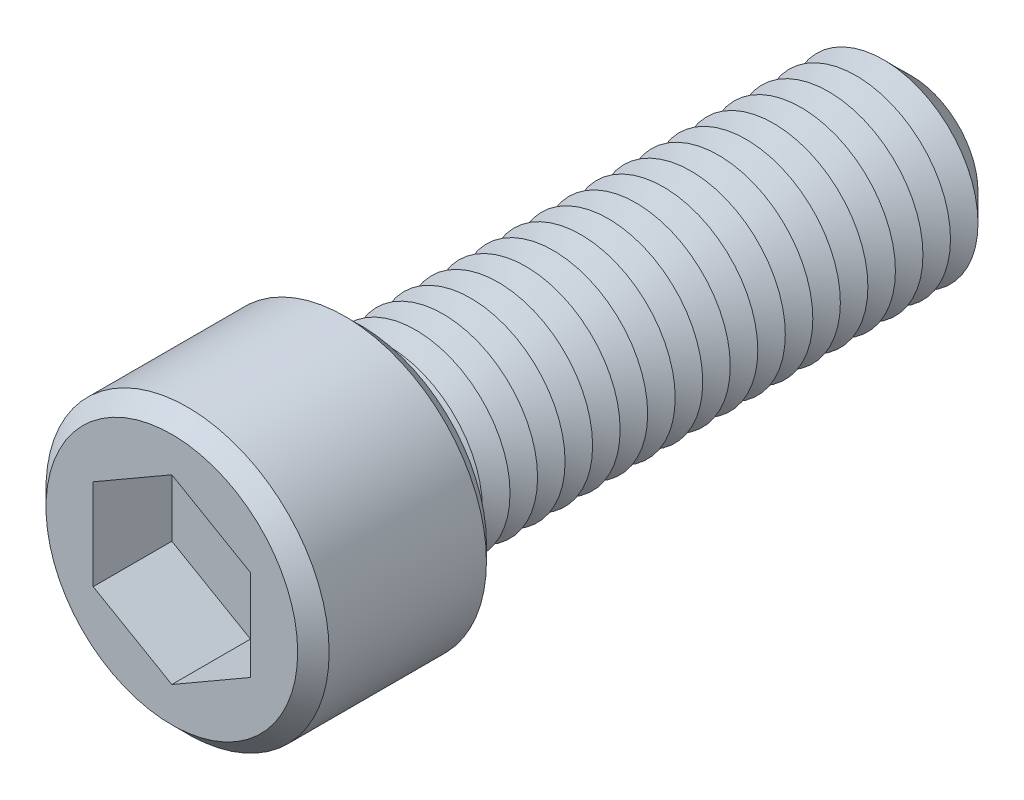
ISO-10303-21;
HEADER;
FILE_DESCRIPTION(('STEP AP214'),'2;1');
FILE_NAME('part.step','',(''),(''),'','','');
FILE_SCHEMA(('AUTOMOTIVE_DESIGN { 1 0 10303 214 1 1 1 1 }'));
ENDSEC;
DATA;
#1=APPLICATION_CONTEXT('core data for automotive mechanical design processes');
#2=APPLICATION_PROTOCOL_DEFINITION('international standard','automotive_design',2000,#1);
#3=PRODUCT_CONTEXT('',#1,'mechanical');
#4=PRODUCT('Part','Part','',(#3));
#5=PRODUCT_RELATED_PRODUCT_CATEGORY('part','',(#4));
#6=PRODUCT_DEFINITION_FORMATION('','',#4);
#7=PRODUCT_DEFINITION_CONTEXT('part definition',#1,'design');
#8=PRODUCT_DEFINITION('design','',#6,#7);
#9=PRODUCT_DEFINITION_SHAPE('','',#8);
#10=(LENGTH_UNIT() NAMED_UNIT(*) SI_UNIT(.MILLI.,.METRE.));
#11=(NAMED_UNIT(*) PLANE_ANGLE_UNIT() SI_UNIT($,.RADIAN.));
#12=(NAMED_UNIT(*) SI_UNIT($,.STERADIAN.) SOLID_ANGLE_UNIT());
#13=UNCERTAINTY_MEASURE_WITH_UNIT(LENGTH_MEASURE(1.E-05),#10,'distance_accuracy_value','');
#14=(GEOMETRIC_REPRESENTATION_CONTEXT(3) GLOBAL_UNCERTAINTY_ASSIGNED_CONTEXT((#13)) GLOBAL_UNIT_ASSIGNED_CONTEXT((#10,
#11,#12)) REPRESENTATION_CONTEXT('',''));
#15=CARTESIAN_POINT('',(0.,0.,0.));
#16=DIRECTION('',(0.,0.,1.));
#17=DIRECTION('',(1.,0.,0.));
#18=AXIS2_PLACEMENT_3D('',#15,#16,#17);
#19=CARTESIAN_POINT('',(0.,0.,12.));
#20=DIRECTION('',(0.,0.,-1.));
#21=DIRECTION('',(-1.,0.,0.));
#22=AXIS2_PLACEMENT_3D('',#19,#20,#21);
#23=CYLINDRICAL_SURFACE('',#22,9.);
#24=CARTESIAN_POINT('',(0.,0.,1.00000000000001));
#25=DIRECTION('',(0.,0.,1.));
#26=DIRECTION('',(1.,0.,0.));
#27=AXIS2_PLACEMENT_3D('',#24,#25,#26);
#28=CIRCLE('',#27,9.);
#29=CARTESIAN_POINT('',(9.,0.,1.00000000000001));
#30=VERTEX_POINT('',#29);
#31=EDGE_CURVE('E328',#30,#30,#28,.T.);
#32=ORIENTED_EDGE('',*,*,#31,.T.);
#33=EDGE_LOOP('',(#32));
#34=FACE_BOUND('',#33,.T.);
#35=CARTESIAN_POINT('',(0.,0.,11.));
#36=DIRECTION('',(0.,0.,1.));
#37=DIRECTION('',(1.,0.,0.));
#38=AXIS2_PLACEMENT_3D('',#35,#36,#37);
#39=CIRCLE('',#38,9.);
#40=CARTESIAN_POINT('',(9.,0.,11.));
#41=VERTEX_POINT('',#40);
#42=EDGE_CURVE('E324',#41,#41,#39,.F.);
#43=ORIENTED_EDGE('',*,*,#42,.T.);
#44=EDGE_LOOP('',(#43));
#45=FACE_BOUND('',#44,.T.);
#46=ADVANCED_FACE('F39',(#34,#45),#23,.T.);
#47=CARTESIAN_POINT('',(0.,0.,12.));
#48=DIRECTION('',(0.,0.,1.));
#49=DIRECTION('',(1.,0.,0.));
#50=AXIS2_PLACEMENT_3D('',#47,#48,#49);
#51=PLANE('',#50);
#52=CARTESIAN_POINT('',(0.,0.,12.));
#53=DIRECTION('',(0.,0.,1.));
#54=DIRECTION('',(1.,0.,0.));
#55=AXIS2_PLACEMENT_3D('',#52,#53,#54);
#56=CIRCLE('',#55,7.99999999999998);
#57=CARTESIAN_POINT('',(7.99999999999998,0.,12.));
#58=VERTEX_POINT('',#57);
#59=EDGE_CURVE('E11',#58,#58,#56,.T.);
#60=ORIENTED_EDGE('',*,*,#59,.T.);
#61=EDGE_LOOP('',(#60));
#62=FACE_BOUND('',#61,.T.);
#63=DIRECTION('',(-0.866025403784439,0.5,0.));
#64=VECTOR('',#63,1.);
#65=CARTESIAN_POINT('',(5.,2.88675134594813,12.));
#66=LINE('',#65,#64);
#67=CARTESIAN_POINT('',(5.,2.88675134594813,12.));
#68=VERTEX_POINT('',#67);
#69=CARTESIAN_POINT('',(0.,5.77350269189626,12.));
#70=VERTEX_POINT('',#69);
#71=EDGE_CURVE('E55',#68,#70,#66,.T.);
#72=ORIENTED_EDGE('',*,*,#71,.F.);
#73=DIRECTION('',(0.,1.,0.));
#74=VECTOR('',#73,1.);
#75=CARTESIAN_POINT('',(5.,-2.88675134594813,12.));
#76=LINE('',#75,#74);
#77=CARTESIAN_POINT('',(5.,-2.88675134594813,12.));
#78=VERTEX_POINT('',#77);
#79=EDGE_CURVE('E151',#78,#68,#76,.T.);
#80=ORIENTED_EDGE('',*,*,#79,.F.);
#81=DIRECTION('',(0.866025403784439,0.5,0.));
#82=VECTOR('',#81,1.);
#83=CARTESIAN_POINT('',(0.,-5.77350269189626,12.));
#84=LINE('',#83,#82);
#85=CARTESIAN_POINT('',(0.,-5.77350269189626,12.));
#86=VERTEX_POINT('',#85);
#87=EDGE_CURVE('E148',#86,#78,#84,.T.);
#88=ORIENTED_EDGE('',*,*,#87,.F.);
#89=DIRECTION('',(0.866025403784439,-0.5,0.));
#90=VECTOR('',#89,1.);
#91=CARTESIAN_POINT('',(-5.,-2.88675134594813,12.));
#92=LINE('',#91,#90);
#93=CARTESIAN_POINT('',(-5.,-2.88675134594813,12.));
#94=VERTEX_POINT('',#93);
#95=EDGE_CURVE('E103',#94,#86,#92,.T.);
#96=ORIENTED_EDGE('',*,*,#95,.F.);
#97=DIRECTION('',(0.,-1.,0.));
#98=VECTOR('',#97,1.);
#99=CARTESIAN_POINT('',(-5.,2.88675134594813,12.));
#100=LINE('',#99,#98);
#101=CARTESIAN_POINT('',(-5.,2.88675134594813,12.));
#102=VERTEX_POINT('',#101);
#103=EDGE_CURVE('E142',#102,#94,#100,.T.);
#104=ORIENTED_EDGE('',*,*,#103,.F.);
#105=DIRECTION('',(-0.866025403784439,-0.5,0.));
#106=VECTOR('',#105,1.);
#107=CARTESIAN_POINT('',(0.,5.77350269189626,12.));
#108=LINE('',#107,#106);
#109=EDGE_CURVE('E137',#70,#102,#108,.T.);
#110=ORIENTED_EDGE('',*,*,#109,.F.);
#111=EDGE_LOOP('',(#72,#80,#88,#96,#104,#110));
#112=FACE_BOUND('',#111,.T.);
#113=ADVANCED_FACE('F346',(#62,#112),#51,.T.);
#114=CARTESIAN_POINT('',(0.,0.,0.));
#115=DIRECTION('',(0.,0.,1.));
#116=DIRECTION('',(1.,0.,0.));
#117=AXIS2_PLACEMENT_3D('',#114,#115,#116);
#118=PLANE('',#117);
#119=CARTESIAN_POINT('',(0.,0.,0.));
#120=DIRECTION('',(0.,0.,1.));
#121=DIRECTION('',(1.,0.,0.));
#122=AXIS2_PLACEMENT_3D('',#119,#120,#121);
#123=CIRCLE('',#122,7.99999999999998);
#124=CARTESIAN_POINT('',(7.99999999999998,0.,0.));
#125=VERTEX_POINT('',#124);
#126=EDGE_CURVE('E48',#125,#125,#123,.F.);
#127=ORIENTED_EDGE('',*,*,#126,.T.);
#128=EDGE_LOOP('',(#127));
#129=FACE_BOUND('',#128,.T.);
#130=CARTESIAN_POINT('',(0.,0.,0.));
#131=DIRECTION('',(0.,0.,1.));
#132=DIRECTION('',(1.,0.,0.));
#133=AXIS2_PLACEMENT_3D('',#130,#131,#132);
#134=CIRCLE('',#133,6.);
#135=CARTESIAN_POINT('',(6.,0.,0.));
#136=VERTEX_POINT('',#135);
#137=EDGE_CURVE('E317',#136,#136,#134,.T.);
#138=ORIENTED_EDGE('',*,*,#137,.T.);
#139=EDGE_LOOP('',(#138));
#140=FACE_BOUND('',#139,.T.);
#141=ADVANCED_FACE('F335',(#129,#140),#118,.F.);
#142=CARTESIAN_POINT('',(0.,0.,0.));
#143=DIRECTION('',(0.,0.,1.));
#144=DIRECTION('',(1.,0.,0.));
#145=AXIS2_PLACEMENT_3D('',#142,#143,#144);
#146=CONICAL_SURFACE('',#145,6.,1.0471975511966);
#147=CARTESIAN_POINT('',(0.,0.,-0.874999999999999));
#148=DIRECTION('',(0.,0.,1.));
#149=DIRECTION('',(1.,0.,0.));
#150=AXIS2_PLACEMENT_3D('',#147,#148,#149);
#151=CIRCLE('',#150,4.48445554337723);
#152=CARTESIAN_POINT('',(4.48445554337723,0.,-0.874999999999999));
#153=VERTEX_POINT('',#152);
#154=EDGE_CURVE('E313',#153,#153,#151,.T.);
#155=ORIENTED_EDGE('',*,*,#154,.T.);
#156=EDGE_LOOP('',(#155));
#157=FACE_BOUND('',#156,.T.);
#158=ORIENTED_EDGE('',*,*,#137,.F.);
#159=EDGE_LOOP('',(#158));
#160=FACE_BOUND('',#159,.T.);
#161=ADVANCED_FACE('F548',(#157,#160),#146,.T.);
#162=CARTESIAN_POINT('',(0.,0.,-0.874999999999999));
#163=DIRECTION('',(0.,0.,-1.));
#164=DIRECTION('',(-1.,0.,0.));
#165=AXIS2_PLACEMENT_3D('',#162,#163,#164);
#166=CONICAL_SURFACE('',#165,4.48445554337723,1.0471975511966);
#167=CARTESIAN_POINT('',(0.,0.,-1.75));
#168=DIRECTION('',(0.,0.,1.));
#169=DIRECTION('',(1.,0.,0.));
#170=AXIS2_PLACEMENT_3D('',#167,#168,#169);
#171=CIRCLE('',#170,6.);
#172=CARTESIAN_POINT('',(6.,0.,-1.75));
#173=VERTEX_POINT('',#172);
#174=EDGE_CURVE('E310',#173,#173,#171,.T.);
#175=ORIENTED_EDGE('',*,*,#174,.T.);
#176=EDGE_LOOP('',(#175));
#177=FACE_BOUND('',#176,.T.);
#178=ORIENTED_EDGE('',*,*,#154,.F.);
#179=EDGE_LOOP('',(#178));
#180=FACE_BOUND('',#179,.T.);
#181=ADVANCED_FACE('F544',(#177,#180),#166,.T.);
#182=CARTESIAN_POINT('',(0.,0.,-1.75));
#183=DIRECTION('',(0.,0.,1.));
#184=DIRECTION('',(1.,0.,0.));
#185=AXIS2_PLACEMENT_3D('',#182,#183,#184);
#186=CONICAL_SURFACE('',#185,6.,1.0471975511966);
#187=CARTESIAN_POINT('',(0.,0.,-2.625));
#188=DIRECTION('',(0.,0.,1.));
#189=DIRECTION('',(1.,0.,0.));
#190=AXIS2_PLACEMENT_3D('',#187,#188,#189);
#191=CIRCLE('',#190,4.48445554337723);
#192=CARTESIAN_POINT('',(4.48445554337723,0.,-2.625));
#193=VERTEX_POINT('',#192);
#194=EDGE_CURVE('E306',#193,#193,#191,.T.);
#195=ORIENTED_EDGE('',*,*,#194,.T.);
#196=EDGE_LOOP('',(#195));
#197=FACE_BOUND('',#196,.T.);
#198=ORIENTED_EDGE('',*,*,#174,.F.);
#199=EDGE_LOOP('',(#198));
#200=FACE_BOUND('',#199,.T.);
#201=ADVANCED_FACE('F540',(#197,#200),#186,.T.);
#202=CARTESIAN_POINT('',(0.,0.,-2.625));
#203=DIRECTION('',(0.,0.,-1.));
#204=DIRECTION('',(-1.,0.,0.));
#205=AXIS2_PLACEMENT_3D('',#202,#203,#204);
#206=CONICAL_SURFACE('',#205,4.48445554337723,1.0471975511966);
#207=CARTESIAN_POINT('',(0.,0.,-3.5));
#208=DIRECTION('',(0.,0.,1.));
#209=DIRECTION('',(1.,0.,0.));
#210=AXIS2_PLACEMENT_3D('',#207,#208,#209);
#211=CIRCLE('',#210,6.);
#212=CARTESIAN_POINT('',(6.,0.,-3.5));
#213=VERTEX_POINT('',#212);
#214=EDGE_CURVE('E302',#213,#213,#211,.T.);
#215=ORIENTED_EDGE('',*,*,#214,.T.);
#216=EDGE_LOOP('',(#215));
#217=FACE_BOUND('',#216,.T.);
#218=ORIENTED_EDGE('',*,*,#194,.F.);
#219=EDGE_LOOP('',(#218));
#220=FACE_BOUND('',#219,.T.);
#221=ADVANCED_FACE('F536',(#217,#220),#206,.T.);
#222=CARTESIAN_POINT('',(0.,0.,-3.5));
#223=DIRECTION('',(0.,0.,1.));
#224=DIRECTION('',(1.,0.,0.));
#225=AXIS2_PLACEMENT_3D('',#222,#223,#224);
#226=CONICAL_SURFACE('',#225,6.,1.0471975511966);
#227=CARTESIAN_POINT('',(0.,0.,-4.375));
#228=DIRECTION('',(0.,0.,1.));
#229=DIRECTION('',(1.,0.,0.));
#230=AXIS2_PLACEMENT_3D('',#227,#228,#229);
#231=CIRCLE('',#230,4.48445554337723);
#232=CARTESIAN_POINT('',(4.48445554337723,0.,-4.375));
#233=VERTEX_POINT('',#232);
#234=EDGE_CURVE('E298',#233,#233,#231,.T.);
#235=ORIENTED_EDGE('',*,*,#234,.T.);
#236=EDGE_LOOP('',(#235));
#237=FACE_BOUND('',#236,.T.);
#238=ORIENTED_EDGE('',*,*,#214,.F.);
#239=EDGE_LOOP('',(#238));
#240=FACE_BOUND('',#239,.T.);
#241=ADVANCED_FACE('F532',(#237,#240),#226,.T.);
#242=CARTESIAN_POINT('',(0.,0.,-4.375));
#243=DIRECTION('',(0.,0.,-1.));
#244=DIRECTION('',(-1.,0.,0.));
#245=AXIS2_PLACEMENT_3D('',#242,#243,#244);
#246=CONICAL_SURFACE('',#245,4.48445554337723,1.0471975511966);
#247=CARTESIAN_POINT('',(0.,0.,-5.25));
#248=DIRECTION('',(0.,0.,1.));
#249=DIRECTION('',(1.,0.,0.));
#250=AXIS2_PLACEMENT_3D('',#247,#248,#249);
#251=CIRCLE('',#250,6.);
#252=CARTESIAN_POINT('',(6.,0.,-5.25));
#253=VERTEX_POINT('',#252);
#254=EDGE_CURVE('E294',#253,#253,#251,.T.);
#255=ORIENTED_EDGE('',*,*,#254,.T.);
#256=EDGE_LOOP('',(#255));
#257=FACE_BOUND('',#256,.T.);
#258=ORIENTED_EDGE('',*,*,#234,.F.);
#259=EDGE_LOOP('',(#258));
#260=FACE_BOUND('',#259,.T.);
#261=ADVANCED_FACE('F528',(#257,#260),#246,.T.);
#262=CARTESIAN_POINT('',(0.,0.,-5.25));
#263=DIRECTION('',(0.,0.,1.));
#264=DIRECTION('',(1.,0.,0.));
#265=AXIS2_PLACEMENT_3D('',#262,#263,#264);
#266=CONICAL_SURFACE('',#265,6.,1.0471975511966);
#267=CARTESIAN_POINT('',(0.,0.,-6.125));
#268=DIRECTION('',(0.,0.,1.));
#269=DIRECTION('',(1.,0.,0.));
#270=AXIS2_PLACEMENT_3D('',#267,#268,#269);
#271=CIRCLE('',#270,4.48445554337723);
#272=CARTESIAN_POINT('',(4.48445554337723,0.,-6.125));
#273=VERTEX_POINT('',#272);
#274=EDGE_CURVE('E290',#273,#273,#271,.T.);
#275=ORIENTED_EDGE('',*,*,#274,.T.);
#276=EDGE_LOOP('',(#275));
#277=FACE_BOUND('',#276,.T.);
#278=ORIENTED_EDGE('',*,*,#254,.F.);
#279=EDGE_LOOP('',(#278));
#280=FACE_BOUND('',#279,.T.);
#281=ADVANCED_FACE('F524',(#277,#280),#266,.T.);
#282=CARTESIAN_POINT('',(0.,0.,-6.125));
#283=DIRECTION('',(0.,0.,-1.));
#284=DIRECTION('',(-1.,0.,0.));
#285=AXIS2_PLACEMENT_3D('',#282,#283,#284);
#286=CONICAL_SURFACE('',#285,4.48445554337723,1.0471975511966);
#287=CARTESIAN_POINT('',(0.,0.,-7.));
#288=DIRECTION('',(0.,0.,1.));
#289=DIRECTION('',(1.,0.,0.));
#290=AXIS2_PLACEMENT_3D('',#287,#288,#289);
#291=CIRCLE('',#290,6.);
#292=CARTESIAN_POINT('',(6.,0.,-7.));
#293=VERTEX_POINT('',#292);
#294=EDGE_CURVE('E286',#293,#293,#291,.T.);
#295=ORIENTED_EDGE('',*,*,#294,.T.);
#296=EDGE_LOOP('',(#295));
#297=FACE_BOUND('',#296,.T.);
#298=ORIENTED_EDGE('',*,*,#274,.F.);
#299=EDGE_LOOP('',(#298));
#300=FACE_BOUND('',#299,.T.);
#301=ADVANCED_FACE('F520',(#297,#300),#286,.T.);
#302=CARTESIAN_POINT('',(0.,0.,-7.));
#303=DIRECTION('',(0.,0.,1.));
#304=DIRECTION('',(1.,0.,0.));
#305=AXIS2_PLACEMENT_3D('',#302,#303,#304);
#306=CONICAL_SURFACE('',#305,6.,1.0471975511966);
#307=CARTESIAN_POINT('',(0.,0.,-7.875));
#308=DIRECTION('',(0.,0.,1.));
#309=DIRECTION('',(1.,0.,0.));
#310=AXIS2_PLACEMENT_3D('',#307,#308,#309);
#311=CIRCLE('',#310,4.48445554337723);
#312=CARTESIAN_POINT('',(4.48445554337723,0.,-7.875));
#313=VERTEX_POINT('',#312);
#314=EDGE_CURVE('E282',#313,#313,#311,.T.);
#315=ORIENTED_EDGE('',*,*,#314,.T.);
#316=EDGE_LOOP('',(#315));
#317=FACE_BOUND('',#316,.T.);
#318=ORIENTED_EDGE('',*,*,#294,.F.);
#319=EDGE_LOOP('',(#318));
#320=FACE_BOUND('',#319,.T.);
#321=ADVANCED_FACE('F516',(#317,#320),#306,.T.);
#322=CARTESIAN_POINT('',(0.,0.,-7.875));
#323=DIRECTION('',(0.,0.,-1.));
#324=DIRECTION('',(-1.,0.,0.));
#325=AXIS2_PLACEMENT_3D('',#322,#323,#324);
#326=CONICAL_SURFACE('',#325,4.48445554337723,1.0471975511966);
#327=CARTESIAN_POINT('',(0.,0.,-8.75));
#328=DIRECTION('',(0.,0.,1.));
#329=DIRECTION('',(1.,0.,0.));
#330=AXIS2_PLACEMENT_3D('',#327,#328,#329);
#331=CIRCLE('',#330,6.);
#332=CARTESIAN_POINT('',(6.,0.,-8.75));
#333=VERTEX_POINT('',#332);
#334=EDGE_CURVE('E278',#333,#333,#331,.T.);
#335=ORIENTED_EDGE('',*,*,#334,.T.);
#336=EDGE_LOOP('',(#335));
#337=FACE_BOUND('',#336,.T.);
#338=ORIENTED_EDGE('',*,*,#314,.F.);
#339=EDGE_LOOP('',(#338));
#340=FACE_BOUND('',#339,.T.);
#341=ADVANCED_FACE('F512',(#337,#340),#326,.T.);
#342=CARTESIAN_POINT('',(0.,0.,-8.75));
#343=DIRECTION('',(0.,0.,1.));
#344=DIRECTION('',(1.,0.,0.));
#345=AXIS2_PLACEMENT_3D('',#342,#343,#344);
#346=CONICAL_SURFACE('',#345,6.,1.0471975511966);
#347=CARTESIAN_POINT('',(0.,0.,-9.625));
#348=DIRECTION('',(0.,0.,1.));
#349=DIRECTION('',(1.,0.,0.));
#350=AXIS2_PLACEMENT_3D('',#347,#348,#349);
#351=CIRCLE('',#350,4.48445554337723);
#352=CARTESIAN_POINT('',(4.48445554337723,0.,-9.625));
#353=VERTEX_POINT('',#352);
#354=EDGE_CURVE('E274',#353,#353,#351,.T.);
#355=ORIENTED_EDGE('',*,*,#354,.T.);
#356=EDGE_LOOP('',(#355));
#357=FACE_BOUND('',#356,.T.);
#358=ORIENTED_EDGE('',*,*,#334,.F.);
#359=EDGE_LOOP('',(#358));
#360=FACE_BOUND('',#359,.T.);
#361=ADVANCED_FACE('F508',(#357,#360),#346,.T.);
#362=CARTESIAN_POINT('',(0.,0.,-9.625));
#363=DIRECTION('',(0.,0.,-1.));
#364=DIRECTION('',(-1.,0.,0.));
#365=AXIS2_PLACEMENT_3D('',#362,#363,#364);
#366=CONICAL_SURFACE('',#365,4.48445554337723,1.0471975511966);
#367=CARTESIAN_POINT('',(0.,0.,-10.5));
#368=DIRECTION('',(0.,0.,1.));
#369=DIRECTION('',(1.,0.,0.));
#370=AXIS2_PLACEMENT_3D('',#367,#368,#369);
#371=CIRCLE('',#370,6.);
#372=CARTESIAN_POINT('',(6.,0.,-10.5));
#373=VERTEX_POINT('',#372);
#374=EDGE_CURVE('E270',#373,#373,#371,.T.);
#375=ORIENTED_EDGE('',*,*,#374,.T.);
#376=EDGE_LOOP('',(#375));
#377=FACE_BOUND('',#376,.T.);
#378=ORIENTED_EDGE('',*,*,#354,.F.);
#379=EDGE_LOOP('',(#378));
#380=FACE_BOUND('',#379,.T.);
#381=ADVANCED_FACE('F504',(#377,#380),#366,.T.);
#382=CARTESIAN_POINT('',(0.,0.,-10.5));
#383=DIRECTION('',(0.,0.,1.));
#384=DIRECTION('',(1.,0.,0.));
#385=AXIS2_PLACEMENT_3D('',#382,#383,#384);
#386=CONICAL_SURFACE('',#385,6.,1.0471975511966);
#387=CARTESIAN_POINT('',(0.,0.,-11.375));
#388=DIRECTION('',(0.,0.,1.));
#389=DIRECTION('',(1.,0.,0.));
#390=AXIS2_PLACEMENT_3D('',#387,#388,#389);
#391=CIRCLE('',#390,4.48445554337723);
#392=CARTESIAN_POINT('',(4.48445554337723,0.,-11.375));
#393=VERTEX_POINT('',#392);
#394=EDGE_CURVE('E266',#393,#393,#391,.T.);
#395=ORIENTED_EDGE('',*,*,#394,.T.);
#396=EDGE_LOOP('',(#395));
#397=FACE_BOUND('',#396,.T.);
#398=ORIENTED_EDGE('',*,*,#374,.F.);
#399=EDGE_LOOP('',(#398));
#400=FACE_BOUND('',#399,.T.);
#401=ADVANCED_FACE('F500',(#397,#400),#386,.T.);
#402=CARTESIAN_POINT('',(0.,0.,-11.375));
#403=DIRECTION('',(0.,0.,-1.));
#404=DIRECTION('',(-1.,0.,0.));
#405=AXIS2_PLACEMENT_3D('',#402,#403,#404);
#406=CONICAL_SURFACE('',#405,4.48445554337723,1.0471975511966);
#407=CARTESIAN_POINT('',(0.,0.,-12.25));
#408=DIRECTION('',(0.,0.,1.));
#409=DIRECTION('',(1.,0.,0.));
#410=AXIS2_PLACEMENT_3D('',#407,#408,#409);
#411=CIRCLE('',#410,6.);
#412=CARTESIAN_POINT('',(6.,0.,-12.25));
#413=VERTEX_POINT('',#412);
#414=EDGE_CURVE('E262',#413,#413,#411,.T.);
#415=ORIENTED_EDGE('',*,*,#414,.T.);
#416=EDGE_LOOP('',(#415));
#417=FACE_BOUND('',#416,.T.);
#418=ORIENTED_EDGE('',*,*,#394,.F.);
#419=EDGE_LOOP('',(#418));
#420=FACE_BOUND('',#419,.T.);
#421=ADVANCED_FACE('F496',(#417,#420),#406,.T.);
#422=CARTESIAN_POINT('',(0.,0.,-12.25));
#423=DIRECTION('',(0.,0.,1.));
#424=DIRECTION('',(1.,0.,0.));
#425=AXIS2_PLACEMENT_3D('',#422,#423,#424);
#426=CONICAL_SURFACE('',#425,6.,1.0471975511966);
#427=CARTESIAN_POINT('',(0.,0.,-13.125));
#428=DIRECTION('',(0.,0.,1.));
#429=DIRECTION('',(1.,0.,0.));
#430=AXIS2_PLACEMENT_3D('',#427,#428,#429);
#431=CIRCLE('',#430,4.48445554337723);
#432=CARTESIAN_POINT('',(4.48445554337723,0.,-13.125));
#433=VERTEX_POINT('',#432);
#434=EDGE_CURVE('E258',#433,#433,#431,.T.);
#435=ORIENTED_EDGE('',*,*,#434,.T.);
#436=EDGE_LOOP('',(#435));
#437=FACE_BOUND('',#436,.T.);
#438=ORIENTED_EDGE('',*,*,#414,.F.);
#439=EDGE_LOOP('',(#438));
#440=FACE_BOUND('',#439,.T.);
#441=ADVANCED_FACE('F492',(#437,#440),#426,.T.);
#442=CARTESIAN_POINT('',(0.,0.,-13.125));
#443=DIRECTION('',(0.,0.,-1.));
#444=DIRECTION('',(-1.,0.,0.));
#445=AXIS2_PLACEMENT_3D('',#442,#443,#444);
#446=CONICAL_SURFACE('',#445,4.48445554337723,1.0471975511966);
#447=CARTESIAN_POINT('',(0.,0.,-14.));
#448=DIRECTION('',(0.,0.,1.));
#449=DIRECTION('',(1.,0.,0.));
#450=AXIS2_PLACEMENT_3D('',#447,#448,#449);
#451=CIRCLE('',#450,6.);
#452=CARTESIAN_POINT('',(6.,0.,-14.));
#453=VERTEX_POINT('',#452);
#454=EDGE_CURVE('E254',#453,#453,#451,.T.);
#455=ORIENTED_EDGE('',*,*,#454,.T.);
#456=EDGE_LOOP('',(#455));
#457=FACE_BOUND('',#456,.T.);
#458=ORIENTED_EDGE('',*,*,#434,.F.);
#459=EDGE_LOOP('',(#458));
#460=FACE_BOUND('',#459,.T.);
#461=ADVANCED_FACE('F488',(#457,#460),#446,.T.);
#462=CARTESIAN_POINT('',(0.,0.,-14.));
#463=DIRECTION('',(0.,0.,1.));
#464=DIRECTION('',(1.,0.,0.));
#465=AXIS2_PLACEMENT_3D('',#462,#463,#464);
#466=CONICAL_SURFACE('',#465,6.,1.0471975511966);
#467=CARTESIAN_POINT('',(0.,0.,-14.875));
#468=DIRECTION('',(0.,0.,1.));
#469=DIRECTION('',(1.,0.,0.));
#470=AXIS2_PLACEMENT_3D('',#467,#468,#469);
#471=CIRCLE('',#470,4.48445554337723);
#472=CARTESIAN_POINT('',(4.48445554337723,0.,-14.875));
#473=VERTEX_POINT('',#472);
#474=EDGE_CURVE('E250',#473,#473,#471,.T.);
#475=ORIENTED_EDGE('',*,*,#474,.T.);
#476=EDGE_LOOP('',(#475));
#477=FACE_BOUND('',#476,.T.);
#478=ORIENTED_EDGE('',*,*,#454,.F.);
#479=EDGE_LOOP('',(#478));
#480=FACE_BOUND('',#479,.T.);
#481=ADVANCED_FACE('F484',(#477,#480),#466,.T.);
#482=CARTESIAN_POINT('',(0.,0.,-14.875));
#483=DIRECTION('',(0.,0.,-1.));
#484=DIRECTION('',(-1.,0.,0.));
#485=AXIS2_PLACEMENT_3D('',#482,#483,#484);
#486=CONICAL_SURFACE('',#485,4.48445554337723,1.0471975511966);
#487=CARTESIAN_POINT('',(0.,0.,-15.75));
#488=DIRECTION('',(0.,0.,1.));
#489=DIRECTION('',(1.,0.,0.));
#490=AXIS2_PLACEMENT_3D('',#487,#488,#489);
#491=CIRCLE('',#490,6.);
#492=CARTESIAN_POINT('',(6.,0.,-15.75));
#493=VERTEX_POINT('',#492);
#494=EDGE_CURVE('E246',#493,#493,#491,.T.);
#495=ORIENTED_EDGE('',*,*,#494,.T.);
#496=EDGE_LOOP('',(#495));
#497=FACE_BOUND('',#496,.T.);
#498=ORIENTED_EDGE('',*,*,#474,.F.);
#499=EDGE_LOOP('',(#498));
#500=FACE_BOUND('',#499,.T.);
#501=ADVANCED_FACE('F480',(#497,#500),#486,.T.);
#502=CARTESIAN_POINT('',(0.,0.,-15.75));
#503=DIRECTION('',(0.,0.,1.));
#504=DIRECTION('',(1.,0.,0.));
#505=AXIS2_PLACEMENT_3D('',#502,#503,#504);
#506=CONICAL_SURFACE('',#505,6.,1.0471975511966);
#507=CARTESIAN_POINT('',(0.,0.,-16.625));
#508=DIRECTION('',(0.,0.,1.));
#509=DIRECTION('',(1.,0.,0.));
#510=AXIS2_PLACEMENT_3D('',#507,#508,#509);
#511=CIRCLE('',#510,4.48445554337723);
#512=CARTESIAN_POINT('',(4.48445554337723,0.,-16.625));
#513=VERTEX_POINT('',#512);
#514=EDGE_CURVE('E242',#513,#513,#511,.T.);
#515=ORIENTED_EDGE('',*,*,#514,.T.);
#516=EDGE_LOOP('',(#515));
#517=FACE_BOUND('',#516,.T.);
#518=ORIENTED_EDGE('',*,*,#494,.F.);
#519=EDGE_LOOP('',(#518));
#520=FACE_BOUND('',#519,.T.);
#521=ADVANCED_FACE('F476',(#517,#520),#506,.T.);
#522=CARTESIAN_POINT('',(0.,0.,-16.625));
#523=DIRECTION('',(0.,0.,-1.));
#524=DIRECTION('',(-1.,0.,0.));
#525=AXIS2_PLACEMENT_3D('',#522,#523,#524);
#526=CONICAL_SURFACE('',#525,4.48445554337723,1.0471975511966);
#527=CARTESIAN_POINT('',(0.,0.,-17.5));
#528=DIRECTION('',(0.,0.,1.));
#529=DIRECTION('',(1.,0.,0.));
#530=AXIS2_PLACEMENT_3D('',#527,#528,#529);
#531=CIRCLE('',#530,6.);
#532=CARTESIAN_POINT('',(6.,0.,-17.5));
#533=VERTEX_POINT('',#532);
#534=EDGE_CURVE('E238',#533,#533,#531,.T.);
#535=ORIENTED_EDGE('',*,*,#534,.T.);
#536=EDGE_LOOP('',(#535));
#537=FACE_BOUND('',#536,.T.);
#538=ORIENTED_EDGE('',*,*,#514,.F.);
#539=EDGE_LOOP('',(#538));
#540=FACE_BOUND('',#539,.T.);
#541=ADVANCED_FACE('F472',(#537,#540),#526,.T.);
#542=CARTESIAN_POINT('',(0.,0.,-17.5));
#543=DIRECTION('',(0.,0.,1.));
#544=DIRECTION('',(1.,0.,0.));
#545=AXIS2_PLACEMENT_3D('',#542,#543,#544);
#546=CONICAL_SURFACE('',#545,6.,1.0471975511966);
#547=CARTESIAN_POINT('',(0.,0.,-18.375));
#548=DIRECTION('',(0.,0.,1.));
#549=DIRECTION('',(1.,0.,0.));
#550=AXIS2_PLACEMENT_3D('',#547,#548,#549);
#551=CIRCLE('',#550,4.48445554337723);
#552=CARTESIAN_POINT('',(4.48445554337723,0.,-18.375));
#553=VERTEX_POINT('',#552);
#554=EDGE_CURVE('E234',#553,#553,#551,.T.);
#555=ORIENTED_EDGE('',*,*,#554,.T.);
#556=EDGE_LOOP('',(#555));
#557=FACE_BOUND('',#556,.T.);
#558=ORIENTED_EDGE('',*,*,#534,.F.);
#559=EDGE_LOOP('',(#558));
#560=FACE_BOUND('',#559,.T.);
#561=ADVANCED_FACE('F468',(#557,#560),#546,.T.);
#562=CARTESIAN_POINT('',(0.,0.,-18.375));
#563=DIRECTION('',(0.,0.,-1.));
#564=DIRECTION('',(-1.,0.,0.));
#565=AXIS2_PLACEMENT_3D('',#562,#563,#564);
#566=CONICAL_SURFACE('',#565,4.48445554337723,1.0471975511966);
#567=CARTESIAN_POINT('',(0.,0.,-19.25));
#568=DIRECTION('',(0.,0.,1.));
#569=DIRECTION('',(1.,0.,0.));
#570=AXIS2_PLACEMENT_3D('',#567,#568,#569);
#571=CIRCLE('',#570,6.);
#572=CARTESIAN_POINT('',(6.,0.,-19.25));
#573=VERTEX_POINT('',#572);
#574=EDGE_CURVE('E230',#573,#573,#571,.T.);
#575=ORIENTED_EDGE('',*,*,#574,.T.);
#576=EDGE_LOOP('',(#575));
#577=FACE_BOUND('',#576,.T.);
#578=ORIENTED_EDGE('',*,*,#554,.F.);
#579=EDGE_LOOP('',(#578));
#580=FACE_BOUND('',#579,.T.);
#581=ADVANCED_FACE('F464',(#577,#580),#566,.T.);
#582=CARTESIAN_POINT('',(0.,0.,-19.25));
#583=DIRECTION('',(0.,0.,1.));
#584=DIRECTION('',(1.,0.,0.));
#585=AXIS2_PLACEMENT_3D('',#582,#583,#584);
#586=CONICAL_SURFACE('',#585,6.,1.0471975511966);
#587=CARTESIAN_POINT('',(0.,0.,-20.125));
#588=DIRECTION('',(0.,0.,1.));
#589=DIRECTION('',(1.,0.,0.));
#590=AXIS2_PLACEMENT_3D('',#587,#588,#589);
#591=CIRCLE('',#590,4.48445554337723);
#592=CARTESIAN_POINT('',(4.48445554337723,0.,-20.125));
#593=VERTEX_POINT('',#592);
#594=EDGE_CURVE('E226',#593,#593,#591,.T.);
#595=ORIENTED_EDGE('',*,*,#594,.T.);
#596=EDGE_LOOP('',(#595));
#597=FACE_BOUND('',#596,.T.);
#598=ORIENTED_EDGE('',*,*,#574,.F.);
#599=EDGE_LOOP('',(#598));
#600=FACE_BOUND('',#599,.T.);
#601=ADVANCED_FACE('F460',(#597,#600),#586,.T.);
#602=CARTESIAN_POINT('',(0.,0.,-20.125));
#603=DIRECTION('',(0.,0.,-1.));
#604=DIRECTION('',(-1.,0.,0.));
#605=AXIS2_PLACEMENT_3D('',#602,#603,#604);
#606=CONICAL_SURFACE('',#605,4.48445554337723,1.0471975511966);
#607=CARTESIAN_POINT('',(0.,0.,-21.));
#608=DIRECTION('',(0.,0.,1.));
#609=DIRECTION('',(1.,0.,0.));
#610=AXIS2_PLACEMENT_3D('',#607,#608,#609);
#611=CIRCLE('',#610,6.);
#612=CARTESIAN_POINT('',(6.,0.,-21.));
#613=VERTEX_POINT('',#612);
#614=EDGE_CURVE('E222',#613,#613,#611,.T.);
#615=ORIENTED_EDGE('',*,*,#614,.T.);
#616=EDGE_LOOP('',(#615));
#617=FACE_BOUND('',#616,.T.);
#618=ORIENTED_EDGE('',*,*,#594,.F.);
#619=EDGE_LOOP('',(#618));
#620=FACE_BOUND('',#619,.T.);
#621=ADVANCED_FACE('F456',(#617,#620),#606,.T.);
#622=CARTESIAN_POINT('',(0.,0.,-21.));
#623=DIRECTION('',(0.,0.,1.));
#624=DIRECTION('',(1.,0.,0.));
#625=AXIS2_PLACEMENT_3D('',#622,#623,#624);
#626=CONICAL_SURFACE('',#625,6.,1.0471975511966);
#627=CARTESIAN_POINT('',(0.,0.,-21.875));
#628=DIRECTION('',(0.,0.,1.));
#629=DIRECTION('',(1.,0.,0.));
#630=AXIS2_PLACEMENT_3D('',#627,#628,#629);
#631=CIRCLE('',#630,4.48445554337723);
#632=CARTESIAN_POINT('',(4.48445554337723,0.,-21.875));
#633=VERTEX_POINT('',#632);
#634=EDGE_CURVE('E218',#633,#633,#631,.T.);
#635=ORIENTED_EDGE('',*,*,#634,.T.);
#636=EDGE_LOOP('',(#635));
#637=FACE_BOUND('',#636,.T.);
#638=ORIENTED_EDGE('',*,*,#614,.F.);
#639=EDGE_LOOP('',(#638));
#640=FACE_BOUND('',#639,.T.);
#641=ADVANCED_FACE('F452',(#637,#640),#626,.T.);
#642=CARTESIAN_POINT('',(0.,0.,-21.875));
#643=DIRECTION('',(0.,0.,-1.));
#644=DIRECTION('',(-1.,0.,0.));
#645=AXIS2_PLACEMENT_3D('',#642,#643,#644);
#646=CONICAL_SURFACE('',#645,4.48445554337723,1.0471975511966);
#647=CARTESIAN_POINT('',(0.,0.,-22.75));
#648=DIRECTION('',(0.,0.,1.));
#649=DIRECTION('',(1.,0.,0.));
#650=AXIS2_PLACEMENT_3D('',#647,#648,#649);
#651=CIRCLE('',#650,6.);
#652=CARTESIAN_POINT('',(6.,0.,-22.75));
#653=VERTEX_POINT('',#652);
#654=EDGE_CURVE('E214',#653,#653,#651,.T.);
#655=ORIENTED_EDGE('',*,*,#654,.T.);
#656=EDGE_LOOP('',(#655));
#657=FACE_BOUND('',#656,.T.);
#658=ORIENTED_EDGE('',*,*,#634,.F.);
#659=EDGE_LOOP('',(#658));
#660=FACE_BOUND('',#659,.T.);
#661=ADVANCED_FACE('F448',(#657,#660),#646,.T.);
#662=CARTESIAN_POINT('',(0.,0.,-22.75));
#663=DIRECTION('',(0.,0.,1.));
#664=DIRECTION('',(1.,0.,0.));
#665=AXIS2_PLACEMENT_3D('',#662,#663,#664);
#666=CONICAL_SURFACE('',#665,6.,1.0471975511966);
#667=CARTESIAN_POINT('',(0.,0.,-23.625));
#668=DIRECTION('',(0.,0.,1.));
#669=DIRECTION('',(1.,0.,0.));
#670=AXIS2_PLACEMENT_3D('',#667,#668,#669);
#671=CIRCLE('',#670,4.48445554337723);
#672=CARTESIAN_POINT('',(4.48445554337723,0.,-23.625));
#673=VERTEX_POINT('',#672);
#674=EDGE_CURVE('E210',#673,#673,#671,.T.);
#675=ORIENTED_EDGE('',*,*,#674,.T.);
#676=EDGE_LOOP('',(#675));
#677=FACE_BOUND('',#676,.T.);
#678=ORIENTED_EDGE('',*,*,#654,.F.);
#679=EDGE_LOOP('',(#678));
#680=FACE_BOUND('',#679,.T.);
#681=ADVANCED_FACE('F444',(#677,#680),#666,.T.);
#682=CARTESIAN_POINT('',(0.,0.,-23.625));
#683=DIRECTION('',(0.,0.,-1.));
#684=DIRECTION('',(-1.,0.,0.));
#685=AXIS2_PLACEMENT_3D('',#682,#683,#684);
#686=CONICAL_SURFACE('',#685,4.48445554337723,1.0471975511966);
#687=CARTESIAN_POINT('',(0.,0.,-24.5));
#688=DIRECTION('',(0.,0.,1.));
#689=DIRECTION('',(1.,0.,0.));
#690=AXIS2_PLACEMENT_3D('',#687,#688,#689);
#691=CIRCLE('',#690,6.);
#692=CARTESIAN_POINT('',(6.,0.,-24.5));
#693=VERTEX_POINT('',#692);
#694=EDGE_CURVE('E206',#693,#693,#691,.T.);
#695=ORIENTED_EDGE('',*,*,#694,.T.);
#696=EDGE_LOOP('',(#695));
#697=FACE_BOUND('',#696,.T.);
#698=ORIENTED_EDGE('',*,*,#674,.F.);
#699=EDGE_LOOP('',(#698));
#700=FACE_BOUND('',#699,.T.);
#701=ADVANCED_FACE('F440',(#697,#700),#686,.T.);
#702=CARTESIAN_POINT('',(0.,0.,-24.5));
#703=DIRECTION('',(0.,0.,1.));
#704=DIRECTION('',(1.,0.,0.));
#705=AXIS2_PLACEMENT_3D('',#702,#703,#704);
#706=CONICAL_SURFACE('',#705,6.,1.0471975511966);
#707=CARTESIAN_POINT('',(0.,0.,-25.375));
#708=DIRECTION('',(0.,0.,1.));
#709=DIRECTION('',(1.,0.,0.));
#710=AXIS2_PLACEMENT_3D('',#707,#708,#709);
#711=CIRCLE('',#710,4.48445554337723);
#712=CARTESIAN_POINT('',(4.48445554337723,0.,-25.375));
#713=VERTEX_POINT('',#712);
#714=EDGE_CURVE('E202',#713,#713,#711,.T.);
#715=ORIENTED_EDGE('',*,*,#714,.T.);
#716=EDGE_LOOP('',(#715));
#717=FACE_BOUND('',#716,.T.);
#718=ORIENTED_EDGE('',*,*,#694,.F.);
#719=EDGE_LOOP('',(#718));
#720=FACE_BOUND('',#719,.T.);
#721=ADVANCED_FACE('F436',(#717,#720),#706,.T.);
#722=CARTESIAN_POINT('',(0.,0.,-25.375));
#723=DIRECTION('',(0.,0.,-1.));
#724=DIRECTION('',(-1.,0.,0.));
#725=AXIS2_PLACEMENT_3D('',#722,#723,#724);
#726=CONICAL_SURFACE('',#725,4.48445554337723,1.0471975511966);
#727=CARTESIAN_POINT('',(0.,0.,-26.25));
#728=DIRECTION('',(0.,0.,1.));
#729=DIRECTION('',(1.,0.,0.));
#730=AXIS2_PLACEMENT_3D('',#727,#728,#729);
#731=CIRCLE('',#730,6.);
#732=CARTESIAN_POINT('',(6.,0.,-26.25));
#733=VERTEX_POINT('',#732);
#734=EDGE_CURVE('E198',#733,#733,#731,.T.);
#735=ORIENTED_EDGE('',*,*,#734,.T.);
#736=EDGE_LOOP('',(#735));
#737=FACE_BOUND('',#736,.T.);
#738=ORIENTED_EDGE('',*,*,#714,.F.);
#739=EDGE_LOOP('',(#738));
#740=FACE_BOUND('',#739,.T.);
#741=ADVANCED_FACE('F432',(#737,#740),#726,.T.);
#742=CARTESIAN_POINT('',(0.,0.,-26.25));
#743=DIRECTION('',(0.,0.,1.));
#744=DIRECTION('',(1.,0.,0.));
#745=AXIS2_PLACEMENT_3D('',#742,#743,#744);
#746=CONICAL_SURFACE('',#745,6.,1.0471975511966);
#747=CARTESIAN_POINT('',(0.,0.,-27.125));
#748=DIRECTION('',(0.,0.,1.));
#749=DIRECTION('',(1.,0.,0.));
#750=AXIS2_PLACEMENT_3D('',#747,#748,#749);
#751=CIRCLE('',#750,4.48445554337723);
#752=CARTESIAN_POINT('',(4.48445554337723,0.,-27.125));
#753=VERTEX_POINT('',#752);
#754=EDGE_CURVE('E194',#753,#753,#751,.T.);
#755=ORIENTED_EDGE('',*,*,#754,.T.);
#756=EDGE_LOOP('',(#755));
#757=FACE_BOUND('',#756,.T.);
#758=ORIENTED_EDGE('',*,*,#734,.F.);
#759=EDGE_LOOP('',(#758));
#760=FACE_BOUND('',#759,.T.);
#761=ADVANCED_FACE('F428',(#757,#760),#746,.T.);
#762=CARTESIAN_POINT('',(0.,0.,-27.125));
#763=DIRECTION('',(0.,0.,-1.));
#764=DIRECTION('',(-1.,0.,0.));
#765=AXIS2_PLACEMENT_3D('',#762,#763,#764);
#766=CONICAL_SURFACE('',#765,4.48445554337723,1.0471975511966);
#767=CARTESIAN_POINT('',(0.,0.,-28.));
#768=DIRECTION('',(0.,0.,1.));
#769=DIRECTION('',(1.,0.,0.));
#770=AXIS2_PLACEMENT_3D('',#767,#768,#769);
#771=CIRCLE('',#770,6.);
#772=CARTESIAN_POINT('',(6.,0.,-28.));
#773=VERTEX_POINT('',#772);
#774=EDGE_CURVE('E190',#773,#773,#771,.T.);
#775=ORIENTED_EDGE('',*,*,#774,.T.);
#776=EDGE_LOOP('',(#775));
#777=FACE_BOUND('',#776,.T.);
#778=ORIENTED_EDGE('',*,*,#754,.F.);
#779=EDGE_LOOP('',(#778));
#780=FACE_BOUND('',#779,.T.);
#781=ADVANCED_FACE('F424',(#777,#780),#766,.T.);
#782=CARTESIAN_POINT('',(0.,0.,-28.));
#783=DIRECTION('',(0.,0.,1.));
#784=DIRECTION('',(1.,0.,0.));
#785=AXIS2_PLACEMENT_3D('',#782,#783,#784);
#786=CONICAL_SURFACE('',#785,6.,1.0471975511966);
#787=CARTESIAN_POINT('',(0.,0.,-28.875));
#788=DIRECTION('',(0.,0.,1.));
#789=DIRECTION('',(1.,0.,0.));
#790=AXIS2_PLACEMENT_3D('',#787,#788,#789);
#791=CIRCLE('',#790,4.48445554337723);
#792=CARTESIAN_POINT('',(4.48445554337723,0.,-28.875));
#793=VERTEX_POINT('',#792);
#794=EDGE_CURVE('E186',#793,#793,#791,.T.);
#795=ORIENTED_EDGE('',*,*,#794,.T.);
#796=EDGE_LOOP('',(#795));
#797=FACE_BOUND('',#796,.T.);
#798=ORIENTED_EDGE('',*,*,#774,.F.);
#799=EDGE_LOOP('',(#798));
#800=FACE_BOUND('',#799,.T.);
#801=ADVANCED_FACE('F420',(#797,#800),#786,.T.);
#802=CARTESIAN_POINT('',(0.,0.,-28.875));
#803=DIRECTION('',(0.,0.,-1.));
#804=DIRECTION('',(-1.,0.,0.));
#805=AXIS2_PLACEMENT_3D('',#802,#803,#804);
#806=CONICAL_SURFACE('',#805,4.48445554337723,1.0471975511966);
#807=CARTESIAN_POINT('',(0.,0.,-29.75));
#808=DIRECTION('',(0.,0.,1.));
#809=DIRECTION('',(1.,0.,0.));
#810=AXIS2_PLACEMENT_3D('',#807,#808,#809);
#811=CIRCLE('',#810,6.);
#812=CARTESIAN_POINT('',(6.,0.,-29.75));
#813=VERTEX_POINT('',#812);
#814=EDGE_CURVE('E182',#813,#813,#811,.T.);
#815=ORIENTED_EDGE('',*,*,#814,.T.);
#816=EDGE_LOOP('',(#815));
#817=FACE_BOUND('',#816,.T.);
#818=ORIENTED_EDGE('',*,*,#794,.F.);
#819=EDGE_LOOP('',(#818));
#820=FACE_BOUND('',#819,.T.);
#821=ADVANCED_FACE('F416',(#817,#820),#806,.T.);
#822=CARTESIAN_POINT('',(0.,0.,-29.75));
#823=DIRECTION('',(0.,0.,1.));
#824=DIRECTION('',(1.,0.,0.));
#825=AXIS2_PLACEMENT_3D('',#822,#823,#824);
#826=CONICAL_SURFACE('',#825,6.,1.0471975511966);
#827=CARTESIAN_POINT('',(0.,0.,-30.625));
#828=DIRECTION('',(0.,0.,1.));
#829=DIRECTION('',(1.,0.,0.));
#830=AXIS2_PLACEMENT_3D('',#827,#828,#829);
#831=CIRCLE('',#830,4.48445554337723);
#832=CARTESIAN_POINT('',(4.48445554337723,0.,-30.625));
#833=VERTEX_POINT('',#832);
#834=EDGE_CURVE('E178',#833,#833,#831,.T.);
#835=ORIENTED_EDGE('',*,*,#834,.T.);
#836=EDGE_LOOP('',(#835));
#837=FACE_BOUND('',#836,.T.);
#838=ORIENTED_EDGE('',*,*,#814,.F.);
#839=EDGE_LOOP('',(#838));
#840=FACE_BOUND('',#839,.T.);
#841=ADVANCED_FACE('F412',(#837,#840),#826,.T.);
#842=CARTESIAN_POINT('',(0.,0.,-30.625));
#843=DIRECTION('',(0.,0.,-1.));
#844=DIRECTION('',(-1.,0.,0.));
#845=AXIS2_PLACEMENT_3D('',#842,#843,#844);
#846=CONICAL_SURFACE('',#845,4.48445554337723,1.0471975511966);
#847=CARTESIAN_POINT('',(0.,0.,-31.5));
#848=DIRECTION('',(0.,0.,1.));
#849=DIRECTION('',(1.,0.,0.));
#850=AXIS2_PLACEMENT_3D('',#847,#848,#849);
#851=CIRCLE('',#850,6.);
#852=CARTESIAN_POINT('',(6.,0.,-31.5));
#853=VERTEX_POINT('',#852);
#854=EDGE_CURVE('E174',#853,#853,#851,.T.);
#855=ORIENTED_EDGE('',*,*,#854,.T.);
#856=EDGE_LOOP('',(#855));
#857=FACE_BOUND('',#856,.T.);
#858=ORIENTED_EDGE('',*,*,#834,.F.);
#859=EDGE_LOOP('',(#858));
#860=FACE_BOUND('',#859,.T.);
#861=ADVANCED_FACE('F408',(#857,#860),#846,.T.);
#862=CARTESIAN_POINT('',(0.,0.,-31.5));
#863=DIRECTION('',(0.,0.,1.));
#864=DIRECTION('',(1.,0.,0.));
#865=AXIS2_PLACEMENT_3D('',#862,#863,#864);
#866=CONICAL_SURFACE('',#865,6.,1.0471975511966);
#867=CARTESIAN_POINT('',(0.,0.,-32.375));
#868=DIRECTION('',(0.,0.,1.));
#869=DIRECTION('',(1.,0.,0.));
#870=AXIS2_PLACEMENT_3D('',#867,#868,#869);
#871=CIRCLE('',#870,4.48445554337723);
#872=CARTESIAN_POINT('',(4.48445554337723,0.,-32.375));
#873=VERTEX_POINT('',#872);
#874=EDGE_CURVE('E170',#873,#873,#871,.T.);
#875=ORIENTED_EDGE('',*,*,#874,.T.);
#876=EDGE_LOOP('',(#875));
#877=FACE_BOUND('',#876,.T.);
#878=ORIENTED_EDGE('',*,*,#854,.F.);
#879=EDGE_LOOP('',(#878));
#880=FACE_BOUND('',#879,.T.);
#881=ADVANCED_FACE('F404',(#877,#880),#866,.T.);
#882=CARTESIAN_POINT('',(0.,0.,-32.375));
#883=DIRECTION('',(0.,0.,-1.));
#884=DIRECTION('',(-1.,0.,0.));
#885=AXIS2_PLACEMENT_3D('',#882,#883,#884);
#886=CONICAL_SURFACE('',#885,4.48445554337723,1.0471975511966);
#887=CARTESIAN_POINT('',(0.,0.,-33.25));
#888=DIRECTION('',(0.,0.,1.));
#889=DIRECTION('',(1.,0.,0.));
#890=AXIS2_PLACEMENT_3D('',#887,#888,#889);
#891=CIRCLE('',#890,6.);
#892=CARTESIAN_POINT('',(6.,0.,-33.25));
#893=VERTEX_POINT('',#892);
#894=EDGE_CURVE('E157',#893,#893,#891,.T.);
#895=ORIENTED_EDGE('',*,*,#894,.T.);
#896=EDGE_LOOP('',(#895));
#897=FACE_BOUND('',#896,.T.);
#898=ORIENTED_EDGE('',*,*,#874,.F.);
#899=EDGE_LOOP('',(#898));
#900=FACE_BOUND('',#899,.T.);
#901=ADVANCED_FACE('F400',(#897,#900),#886,.T.);
#902=CARTESIAN_POINT('',(0.,0.,-35.));
#903=DIRECTION('',(0.,0.,-1.));
#904=DIRECTION('',(-1.,0.,0.));
#905=AXIS2_PLACEMENT_3D('',#902,#903,#904);
#906=PLANE('',#905);
#907=CARTESIAN_POINT('',(0.,0.,-35.));
#908=DIRECTION('',(0.,0.,-1.));
#909=DIRECTION('',(-1.,0.,0.));
#910=AXIS2_PLACEMENT_3D('',#907,#908,#909);
#911=CIRCLE('',#910,0.9);
#912=CARTESIAN_POINT('',(-0.9,0.,-35.));
#913=VERTEX_POINT('',#912);
#914=EDGE_CURVE('E138',#913,#913,#911,.F.);
#915=ORIENTED_EDGE('',*,*,#914,.T.);
#916=EDGE_LOOP('',(#915));
#917=FACE_BOUND('',#916,.T.);
#918=CARTESIAN_POINT('',(0.,0.,-35.));
#919=DIRECTION('',(0.,0.,-1.));
#920=DIRECTION('',(-1.,0.,0.));
#921=AXIS2_PLACEMENT_3D('',#918,#919,#920);
#922=CIRCLE('',#921,4.25);
#923=CARTESIAN_POINT('',(-4.25,0.,-35.));
#924=VERTEX_POINT('',#923);
#925=EDGE_CURVE('E321',#924,#924,#922,.T.);
#926=ORIENTED_EDGE('',*,*,#925,.T.);
#927=EDGE_LOOP('',(#926));
#928=FACE_BOUND('',#927,.T.);
#929=ADVANCED_FACE('F403',(#917,#928),#906,.T.);
#930=CARTESIAN_POINT('',(0.,0.,-35.));
#931=DIRECTION('',(0.,0.,1.));
#932=DIRECTION('',(1.,0.,0.));
#933=AXIS2_PLACEMENT_3D('',#930,#931,#932);
#934=CONICAL_SURFACE('',#933,4.25,0.785398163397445);
#935=ORIENTED_EDGE('',*,*,#894,.F.);
#936=EDGE_LOOP('',(#935));
#937=FACE_BOUND('',#936,.T.);
#938=ORIENTED_EDGE('',*,*,#925,.F.);
#939=EDGE_LOOP('',(#938));
#940=FACE_BOUND('',#939,.T.);
#941=ADVANCED_FACE('F399',(#937,#940),#934,.T.);
#942=CARTESIAN_POINT('',(5.,2.88675134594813,7.));
#943=DIRECTION('',(0.5,0.866025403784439,0.));
#944=DIRECTION('',(-0.866025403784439,0.5,0.));
#945=AXIS2_PLACEMENT_3D('',#942,#943,#944);
#946=PLANE('',#945);
#947=ORIENTED_EDGE('',*,*,#71,.T.);
#948=DIRECTION('',(0.,0.,1.));
#949=VECTOR('',#948,1.);
#950=CARTESIAN_POINT('',(0.,5.77350269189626,7.));
#951=LINE('',#950,#949);
#952=CARTESIAN_POINT('',(0.,5.77350269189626,7.));
#953=VERTEX_POINT('',#952);
#954=EDGE_CURVE('E85',#953,#70,#951,.T.);
#955=ORIENTED_EDGE('',*,*,#954,.F.);
#956=DIRECTION('',(-0.866025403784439,0.5,0.));
#957=VECTOR('',#956,1.);
#958=CARTESIAN_POINT('',(5.,2.88675134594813,7.));
#959=LINE('',#958,#957);
#960=CARTESIAN_POINT('',(5.,2.88675134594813,7.));
#961=VERTEX_POINT('',#960);
#962=EDGE_CURVE('E154',#961,#953,#959,.T.);
#963=ORIENTED_EDGE('',*,*,#962,.F.);
#964=DIRECTION('',(0.,0.,1.));
#965=VECTOR('',#964,1.);
#966=CARTESIAN_POINT('',(5.,2.88675134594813,7.));
#967=LINE('',#966,#965);
#968=EDGE_CURVE('E63',#961,#68,#967,.T.);
#969=ORIENTED_EDGE('',*,*,#968,.T.);
#970=EDGE_LOOP('',(#947,#955,#963,#969));
#971=FACE_BOUND('',#970,.T.);
#972=ADVANCED_FACE('F389',(#971),#946,.F.);
#973=CARTESIAN_POINT('',(5.,-2.88675134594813,7.));
#974=DIRECTION('',(1.,0.,0.));
#975=DIRECTION('',(0.,0.,-1.));
#976=AXIS2_PLACEMENT_3D('',#973,#974,#975);
#977=PLANE('',#976);
#978=ORIENTED_EDGE('',*,*,#79,.T.);
#979=ORIENTED_EDGE('',*,*,#968,.F.);
#980=DIRECTION('',(0.,1.,0.));
#981=VECTOR('',#980,1.);
#982=CARTESIAN_POINT('',(5.,-2.88675134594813,7.));
#983=LINE('',#982,#981);
#984=CARTESIAN_POINT('',(5.,-2.88675134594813,7.));
#985=VERTEX_POINT('',#984);
#986=EDGE_CURVE('E117',#985,#961,#983,.T.);
#987=ORIENTED_EDGE('',*,*,#986,.F.);
#988=DIRECTION('',(0.,0.,1.));
#989=VECTOR('',#988,1.);
#990=CARTESIAN_POINT('',(5.,-2.88675134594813,7.));
#991=LINE('',#990,#989);
#992=EDGE_CURVE('E108',#985,#78,#991,.T.);
#993=ORIENTED_EDGE('',*,*,#992,.T.);
#994=EDGE_LOOP('',(#978,#979,#987,#993));
#995=FACE_BOUND('',#994,.T.);
#996=ADVANCED_FACE('F386',(#995),#977,.F.);
#997=CARTESIAN_POINT('',(0.,-5.77350269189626,7.));
#998=DIRECTION('',(0.5,-0.866025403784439,0.));
#999=DIRECTION('',(0.866025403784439,0.5,0.));
#1000=AXIS2_PLACEMENT_3D('',#997,#998,#999);
#1001=PLANE('',#1000);
#1002=ORIENTED_EDGE('',*,*,#87,.T.);
#1003=ORIENTED_EDGE('',*,*,#992,.F.);
#1004=DIRECTION('',(0.866025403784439,0.5,0.));
#1005=VECTOR('',#1004,1.);
#1006=CARTESIAN_POINT('',(0.,-5.77350269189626,7.));
#1007=LINE('',#1006,#1005);
#1008=CARTESIAN_POINT('',(0.,-5.77350269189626,7.));
#1009=VERTEX_POINT('',#1008);
#1010=EDGE_CURVE('E112',#1009,#985,#1007,.T.);
#1011=ORIENTED_EDGE('',*,*,#1010,.F.);
#1012=DIRECTION('',(0.,0.,1.));
#1013=VECTOR('',#1012,1.);
#1014=CARTESIAN_POINT('',(0.,-5.77350269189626,7.));
#1015=LINE('',#1014,#1013);
#1016=EDGE_CURVE('E96',#1009,#86,#1015,.T.);
#1017=ORIENTED_EDGE('',*,*,#1016,.T.);
#1018=EDGE_LOOP('',(#1002,#1003,#1011,#1017));
#1019=FACE_BOUND('',#1018,.T.);
#1020=ADVANCED_FACE('F113',(#1019),#1001,.F.);
#1021=CARTESIAN_POINT('',(-5.,-2.88675134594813,7.));
#1022=DIRECTION('',(-0.5,-0.866025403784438,0.));
#1023=DIRECTION('',(0.866025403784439,-0.5,0.));
#1024=AXIS2_PLACEMENT_3D('',#1021,#1022,#1023);
#1025=PLANE('',#1024);
#1026=ORIENTED_EDGE('',*,*,#95,.T.);
#1027=ORIENTED_EDGE('',*,*,#1016,.F.);
#1028=DIRECTION('',(0.866025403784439,-0.5,0.));
#1029=VECTOR('',#1028,1.);
#1030=CARTESIAN_POINT('',(-5.,-2.88675134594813,7.));
#1031=LINE('',#1030,#1029);
#1032=CARTESIAN_POINT('',(-5.,-2.88675134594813,7.));
#1033=VERTEX_POINT('',#1032);
#1034=EDGE_CURVE('E100',#1033,#1009,#1031,.T.);
#1035=ORIENTED_EDGE('',*,*,#1034,.F.);
#1036=DIRECTION('',(0.,0.,1.));
#1037=VECTOR('',#1036,1.);
#1038=CARTESIAN_POINT('',(-5.,-2.88675134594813,7.));
#1039=LINE('',#1038,#1037);
#1040=EDGE_CURVE('E109',#1033,#94,#1039,.T.);
#1041=ORIENTED_EDGE('',*,*,#1040,.T.);
#1042=EDGE_LOOP('',(#1026,#1027,#1035,#1041));
#1043=FACE_BOUND('',#1042,.T.);
#1044=ADVANCED_FACE('F98',(#1043),#1025,.F.);
#1045=CARTESIAN_POINT('',(-5.,2.88675134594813,7.));
#1046=DIRECTION('',(-1.,0.,0.));
#1047=DIRECTION('',(0.,-1.,0.));
#1048=AXIS2_PLACEMENT_3D('',#1045,#1046,#1047);
#1049=PLANE('',#1048);
#1050=ORIENTED_EDGE('',*,*,#103,.T.);
#1051=ORIENTED_EDGE('',*,*,#1040,.F.);
#1052=DIRECTION('',(0.,-1.,0.));
#1053=VECTOR('',#1052,1.);
#1054=CARTESIAN_POINT('',(-5.,2.88675134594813,7.));
#1055=LINE('',#1054,#1053);
#1056=CARTESIAN_POINT('',(-5.,2.88675134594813,7.));
#1057=VERTEX_POINT('',#1056);
#1058=EDGE_CURVE('E123',#1057,#1033,#1055,.T.);
#1059=ORIENTED_EDGE('',*,*,#1058,.F.);
#1060=DIRECTION('',(0.,0.,1.));
#1061=VECTOR('',#1060,1.);
#1062=CARTESIAN_POINT('',(-5.,2.88675134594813,7.));
#1063=LINE('',#1062,#1061);
#1064=EDGE_CURVE('E162',#1057,#102,#1063,.T.);
#1065=ORIENTED_EDGE('',*,*,#1064,.T.);
#1066=EDGE_LOOP('',(#1050,#1051,#1059,#1065));
#1067=FACE_BOUND('',#1066,.T.);
#1068=ADVANCED_FACE('F383',(#1067),#1049,.F.);
#1069=CARTESIAN_POINT('',(0.,5.77350269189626,7.));
#1070=DIRECTION('',(-0.5,0.866025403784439,0.));
#1071=DIRECTION('',(-0.866025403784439,-0.5,0.));
#1072=AXIS2_PLACEMENT_3D('',#1069,#1070,#1071);
#1073=PLANE('',#1072);
#1074=ORIENTED_EDGE('',*,*,#109,.T.);
#1075=ORIENTED_EDGE('',*,*,#1064,.F.);
#1076=DIRECTION('',(-0.866025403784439,-0.5,0.));
#1077=VECTOR('',#1076,1.);
#1078=CARTESIAN_POINT('',(0.,5.77350269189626,7.));
#1079=LINE('',#1078,#1077);
#1080=EDGE_CURVE('E129',#953,#1057,#1079,.T.);
#1081=ORIENTED_EDGE('',*,*,#1080,.F.);
#1082=ORIENTED_EDGE('',*,*,#954,.T.);
#1083=EDGE_LOOP('',(#1074,#1075,#1081,#1082));
#1084=FACE_BOUND('',#1083,.T.);
#1085=ADVANCED_FACE('F361',(#1084),#1073,.F.);
#1086=CARTESIAN_POINT('',(0.,0.,7.));
#1087=DIRECTION('',(0.,0.,1.));
#1088=DIRECTION('',(1.,0.,0.));
#1089=AXIS2_PLACEMENT_3D('',#1086,#1087,#1088);
#1090=PLANE('',#1089);
#1091=CARTESIAN_POINT('',(0.,0.,7.));
#1092=DIRECTION('',(0.,0.,1.));
#1093=DIRECTION('',(1.,0.,0.));
#1094=AXIS2_PLACEMENT_3D('',#1091,#1092,#1093);
#1095=CIRCLE('',#1094,0.9);
#1096=CARTESIAN_POINT('',(0.9,0.,7.));
#1097=VERTEX_POINT('',#1096);
#1098=EDGE_CURVE('E369',#1097,#1097,#1095,.T.);
#1099=ORIENTED_EDGE('',*,*,#1098,.F.);
#1100=EDGE_LOOP('',(#1099));
#1101=FACE_BOUND('',#1100,.T.);
#1102=ORIENTED_EDGE('',*,*,#962,.T.);
#1103=ORIENTED_EDGE('',*,*,#1080,.T.);
#1104=ORIENTED_EDGE('',*,*,#1058,.T.);
#1105=ORIENTED_EDGE('',*,*,#1034,.T.);
#1106=ORIENTED_EDGE('',*,*,#1010,.T.);
#1107=ORIENTED_EDGE('',*,*,#986,.T.);
#1108=EDGE_LOOP('',(#1102,#1103,#1104,#1105,#1106,#1107));
#1109=FACE_BOUND('',#1108,.T.);
#1110=ADVANCED_FACE('F120',(#1101,#1109),#1090,.T.);
#1111=CARTESIAN_POINT('',(0.,0.,-37.5455844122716));
#1112=DIRECTION('',(0.,0.,1.));
#1113=DIRECTION('',(1.,0.,0.));
#1114=AXIS2_PLACEMENT_3D('',#1111,#1112,#1113);
#1115=CYLINDRICAL_SURFACE('',#1114,0.9);
#1116=ORIENTED_EDGE('',*,*,#1098,.T.);
#1117=EDGE_LOOP('',(#1116));
#1118=FACE_BOUND('',#1117,.T.);
#1119=ORIENTED_EDGE('',*,*,#914,.F.);
#1120=EDGE_LOOP('',(#1119));
#1121=FACE_BOUND('',#1120,.T.);
#1122=ADVANCED_FACE('F341',(#1118,#1121),#1115,.F.);
#1123=CARTESIAN_POINT('',(0.,0.,1.00000000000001));
#1124=DIRECTION('',(0.,0.,1.));
#1125=DIRECTION('',(1.,0.,0.));
#1126=AXIS2_PLACEMENT_3D('',#1123,#1124,#1125);
#1127=CONICAL_SURFACE('',#1126,9.,0.785398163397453);
#1128=ORIENTED_EDGE('',*,*,#126,.F.);
#1129=EDGE_LOOP('',(#1128));
#1130=FACE_BOUND('',#1129,.T.);
#1131=ORIENTED_EDGE('',*,*,#31,.F.);
#1132=EDGE_LOOP('',(#1131));
#1133=FACE_BOUND('',#1132,.T.);
#1134=ADVANCED_FACE('F338',(#1130,#1133),#1127,.T.);
#1135=CARTESIAN_POINT('',(0.,0.,12.));
#1136=DIRECTION('',(0.,0.,-1.));
#1137=DIRECTION('',(-1.,0.,0.));
#1138=AXIS2_PLACEMENT_3D('',#1135,#1136,#1137);
#1139=CONICAL_SURFACE('',#1138,7.99999999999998,0.78539816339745);
#1140=ORIENTED_EDGE('',*,*,#42,.F.);
#1141=EDGE_LOOP('',(#1140));
#1142=FACE_BOUND('',#1141,.T.);
#1143=ORIENTED_EDGE('',*,*,#59,.F.);
#1144=EDGE_LOOP('',(#1143));
#1145=FACE_BOUND('',#1144,.T.);
#1146=ADVANCED_FACE('F41',(#1142,#1145),#1139,.T.);
#1147=CLOSED_SHELL('',(#46,#113,#141,#161,#181,#201,#221,#241,#261,#281,#301,#321,#341,#361,
#381,#401,#421,#441,#461,#481,#501,#521,#541,#561,#581,#601,#621,#641,#661,#681,#701,#721,#741,
#761,#781,#801,#821,#841,#861,#881,#901,#929,#941,#972,#996,#1020,#1044,#1068,#1085,#1110,#1122,
#1134,#1146));
#1148=MANIFOLD_SOLID_BREP('B2',#1147);
#1149=ADVANCED_BREP_SHAPE_REPRESENTATION('',(#18,#1148),#14);
#1150=SHAPE_DEFINITION_REPRESENTATION(#9,#1149);
ENDSEC;
END-ISO-10303-21;
